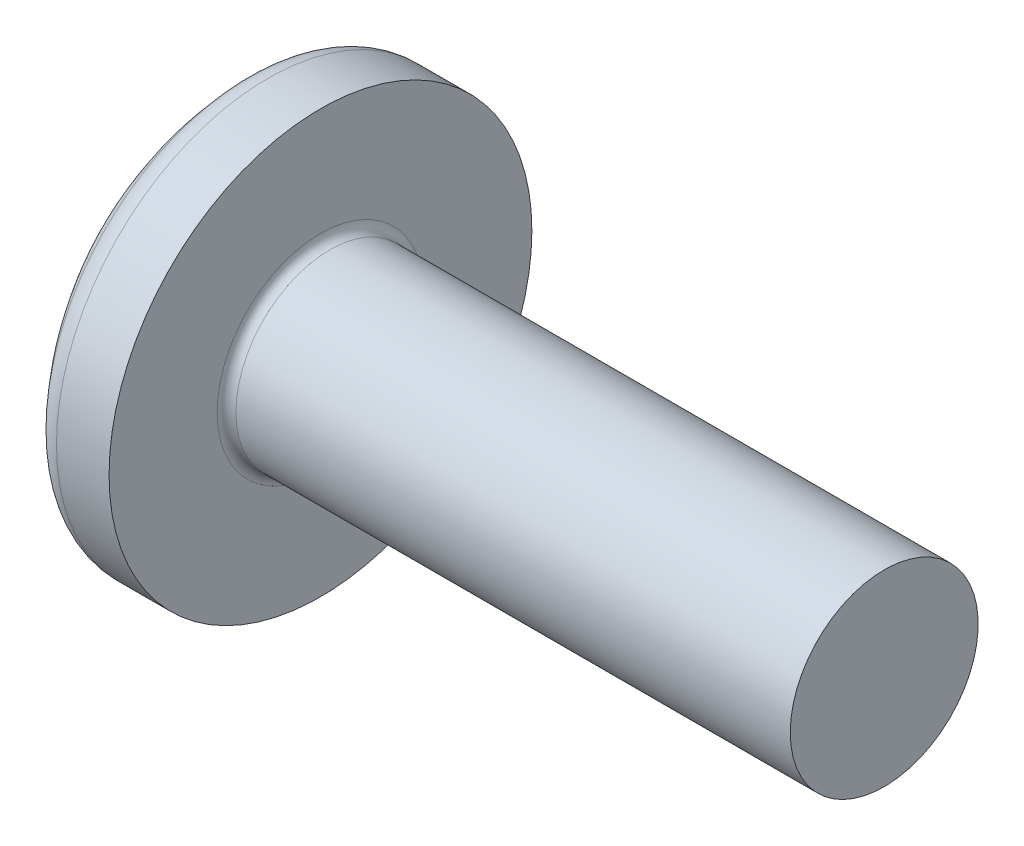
from build123d import *

# Parameters (mm, degrees)
FILLET1_R    = 0.1
RECPAT_COUNT = 2
RECPAT_ANGLE = 90


with BuildPart() as part:
    # BodySke → Base-Revolve (revolve)
    with BuildSketch(Plane.XY, mode=Mode.PRIVATE) as base_revolve_sk:
        with BuildLine():
            Line((1.6, 1), (1.6, 2.25))
            Line((1.6, 2.25), (1.040254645, 2.25))
            ThreePointArc((1.040254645, 2.25), (0.931542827, 2.227147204), (0.841233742, 2.162457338))
            ThreePointArc((0.841233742, 2.162457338), (0.217714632, 1.16016119), (0, 0))
            Line((0, 0), (7.6, 0))
            Line((7.6, 0), (7.6, 1))
            Line((7.6, 1), (1.6, 1))
        make_face()
    revolve(base_revolve_sk.sketch.rotate(Axis((-25.4, 0, 0), (1, 0, 0)), 90), axis=Axis((-25.4, 0, 0), (1, 0, 0)))

    # Fillet1
    fillet1_edges = [part.edges().sort_by_distance(p)[0] for p in [
        (1.6, 0, -1),
    ]]
    fillet(fillet1_edges, radius=FILLET1_R)

    # Sketch3 → Recess section 0
    with BuildSketch(Plane(origin=(0, 0, 0), x_dir=(0, 0, -1), z_dir=(1, 0, 0))):
        with BuildLine():
            Line((0.37, -0.95), (-0.37, -0.95))
            Line((-0.37, -0.95), (-0.37, 0.95))
            Line((-0.37, 0.95), (0.37, 0.95))
            Line((0.37, 0.95), (0.37, -0.95))
        make_face()
    # Sketch4 → Recess section 1
    with BuildSketch(Plane(origin=(1.75, 0, 0), x_dir=(0, 0, -1), z_dir=(1, 0, 0))):
        with BuildLine():
            Line((0.37, -0.527482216), (-0.37, -0.527482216))
            Line((-0.37, -0.527482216), (-0.37, 0.527482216))
            Line((-0.37, 0.527482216), (0.37, 0.527482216))
            Line((0.37, 0.527482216), (0.37, -0.527482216))
        make_face()
    recess = loft(mode=Mode.SUBTRACT)

    # RecPat: Recess ×2 about axis
    recpat_axis = Axis((0, 0, 0), (1, 0, 0))
    for i in range(1, RECPAT_COUNT):
        add(recess.rotate(recpat_axis, i * RECPAT_ANGLE / (RECPAT_COUNT - 1)), mode=Mode.SUBTRACT)

    # RecCorSke → RecessCore (revolve, cut)
    with BuildSketch(Plane.XY, mode=Mode.PRIVATE) as recesscore_sk:
        Polygon((0, 0), (0, 0.678371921), (1.75, 0.556), (1.930655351, 0), align=None)
    revolve(recesscore_sk.sketch.rotate(Axis((-3.175, 0, 0), (1, 0, 0)), 22.071251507), axis=Axis((-3.175, 0, 0), (1, 0, 0)), mode=Mode.SUBTRACT)


solid = part.part
